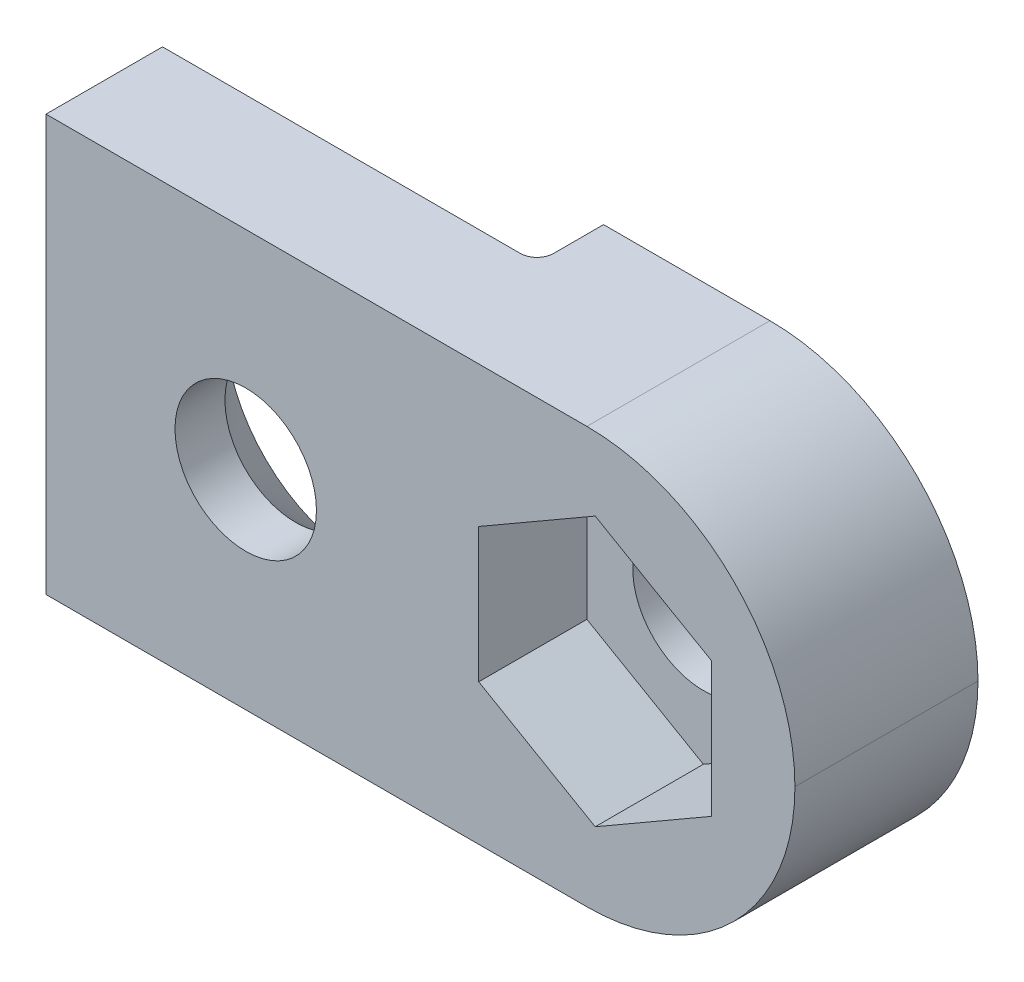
ISO-10303-21;
HEADER;
FILE_DESCRIPTION(('STEP AP214'),'2;1');
FILE_NAME('part.step','',(''),(''),'','','');
FILE_SCHEMA(('AUTOMOTIVE_DESIGN { 1 0 10303 214 1 1 1 1 }'));
ENDSEC;
DATA;
#1=APPLICATION_CONTEXT('core data for automotive mechanical design processes');
#2=APPLICATION_PROTOCOL_DEFINITION('international standard','automotive_design',2000,#1);
#3=PRODUCT_CONTEXT('',#1,'mechanical');
#4=PRODUCT('Part','Part','',(#3));
#5=PRODUCT_RELATED_PRODUCT_CATEGORY('part','',(#4));
#6=PRODUCT_DEFINITION_FORMATION('','',#4);
#7=PRODUCT_DEFINITION_CONTEXT('part definition',#1,'design');
#8=PRODUCT_DEFINITION('design','',#6,#7);
#9=PRODUCT_DEFINITION_SHAPE('','',#8);
#10=(LENGTH_UNIT() NAMED_UNIT(*) SI_UNIT(.MILLI.,.METRE.));
#11=(NAMED_UNIT(*) PLANE_ANGLE_UNIT() SI_UNIT($,.RADIAN.));
#12=(NAMED_UNIT(*) SI_UNIT($,.STERADIAN.) SOLID_ANGLE_UNIT());
#13=UNCERTAINTY_MEASURE_WITH_UNIT(LENGTH_MEASURE(1.E-05),#10,'distance_accuracy_value','');
#14=(GEOMETRIC_REPRESENTATION_CONTEXT(3) GLOBAL_UNCERTAINTY_ASSIGNED_CONTEXT((#13)) GLOBAL_UNIT_ASSIGNED_CONTEXT((#10,
#11,#12)) REPRESENTATION_CONTEXT('',''));
#15=CARTESIAN_POINT('',(0.,0.,0.));
#16=DIRECTION('',(0.,0.,1.));
#17=DIRECTION('',(1.,0.,0.));
#18=AXIS2_PLACEMENT_3D('',#15,#16,#17);
#19=CARTESIAN_POINT('',(-8.69268169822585,-1.07482881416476,4.4));
#20=DIRECTION('',(0.,0.,-1.));
#21=DIRECTION('',(-1.,0.,0.));
#22=AXIS2_PLACEMENT_3D('',#19,#20,#21);
#23=CYLINDRICAL_SURFACE('',#22,1.7);
#24=CARTESIAN_POINT('',(-8.69268169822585,-1.07482881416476,4.4));
#25=DIRECTION('',(0.,0.,1.));
#26=DIRECTION('',(1.,0.,0.));
#27=AXIS2_PLACEMENT_3D('',#24,#25,#26);
#28=CIRCLE('',#27,1.7);
#29=CARTESIAN_POINT('',(-6.99268169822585,-1.07482881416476,4.4));
#30=VERTEX_POINT('',#29);
#31=EDGE_CURVE('E252',#30,#30,#28,.T.);
#32=ORIENTED_EDGE('',*,*,#31,.T.);
#33=EDGE_LOOP('',(#32));
#34=FACE_BOUND('',#33,.T.);
#35=CARTESIAN_POINT('',(-8.69268169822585,-1.07482881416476,3.2));
#36=DIRECTION('',(0.,0.,-1.));
#37=DIRECTION('',(-1.,0.,0.));
#38=AXIS2_PLACEMENT_3D('',#35,#36,#37);
#39=CIRCLE('',#38,1.7);
#40=CARTESIAN_POINT('',(-10.3926816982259,-1.07482881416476,3.2));
#41=VERTEX_POINT('',#40);
#42=EDGE_CURVE('E277',#41,#41,#39,.T.);
#43=ORIENTED_EDGE('',*,*,#42,.T.);
#44=EDGE_LOOP('',(#43));
#45=FACE_BOUND('',#44,.T.);
#46=ADVANCED_FACE('F35',(#34,#45),#23,.F.);
#47=CARTESIAN_POINT('',(0.,0.,0.));
#48=DIRECTION('',(0.,0.,1.));
#49=DIRECTION('',(1.,0.,0.));
#50=AXIS2_PLACEMENT_3D('',#47,#48,#49);
#51=PLANE('',#50);
#52=CARTESIAN_POINT('',(-0.292681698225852,-1.07482881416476,0.));
#53=DIRECTION('',(0.,0.,1.));
#54=DIRECTION('',(1.,0.,0.));
#55=AXIS2_PLACEMENT_3D('',#52,#53,#54);
#56=CIRCLE('',#55,1.7);
#57=CARTESIAN_POINT('',(1.40731830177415,-1.07482881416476,0.));
#58=VERTEX_POINT('',#57);
#59=EDGE_CURVE('E196',#58,#58,#56,.T.);
#60=ORIENTED_EDGE('',*,*,#59,.T.);
#61=EDGE_LOOP('',(#60));
#62=FACE_BOUND('',#61,.T.);
#63=DIRECTION('',(0.,1.,0.));
#64=VECTOR('',#63,1.);
#65=CARTESIAN_POINT('',(-4.49268169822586,3.92517118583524,0.));
#66=LINE('',#65,#64);
#67=CARTESIAN_POINT('',(-4.49268169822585,-6.07482881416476,0.));
#68=VERTEX_POINT('',#67);
#69=CARTESIAN_POINT('',(-4.49268169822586,3.92517118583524,0.));
#70=VERTEX_POINT('',#69);
#71=EDGE_CURVE('E149',#68,#70,#66,.T.);
#72=ORIENTED_EDGE('',*,*,#71,.T.);
#73=DIRECTION('',(-1.,0.,0.));
#74=VECTOR('',#73,1.);
#75=CARTESIAN_POINT('',(-13.4926816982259,3.92517118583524,0.));
#76=LINE('',#75,#74);
#77=CARTESIAN_POINT('',(-0.492681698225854,3.92517118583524,0.));
#78=VERTEX_POINT('',#77);
#79=EDGE_CURVE('E194',#78,#70,#76,.T.);
#80=ORIENTED_EDGE('',*,*,#79,.F.);
#81=CARTESIAN_POINT('',(-0.492681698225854,-1.07482881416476,0.));
#82=DIRECTION('',(0.,0.,1.));
#83=DIRECTION('',(1.,0.,0.));
#84=AXIS2_PLACEMENT_3D('',#81,#82,#83);
#85=CIRCLE('',#84,5.);
#86=CARTESIAN_POINT('',(4.50731830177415,-1.07482881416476,0.));
#87=VERTEX_POINT('',#86);
#88=EDGE_CURVE('E156',#78,#87,#85,.F.);
#89=ORIENTED_EDGE('',*,*,#88,.T.);
#90=CARTESIAN_POINT('',(-0.492681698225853,-1.07482881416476,0.));
#91=DIRECTION('',(0.,0.,1.));
#92=DIRECTION('',(1.,0.,0.));
#93=AXIS2_PLACEMENT_3D('',#90,#91,#92);
#94=CIRCLE('',#93,5.);
#95=CARTESIAN_POINT('',(-0.492681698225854,-6.07482881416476,0.));
#96=VERTEX_POINT('',#95);
#97=EDGE_CURVE('E158',#87,#96,#94,.F.);
#98=ORIENTED_EDGE('',*,*,#97,.T.);
#99=DIRECTION('',(1.,0.,0.));
#100=VECTOR('',#99,1.);
#101=CARTESIAN_POINT('',(-13.4926816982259,-6.07482881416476,0.));
#102=LINE('',#101,#100);
#103=EDGE_CURVE('E255',#68,#96,#102,.T.);
#104=ORIENTED_EDGE('',*,*,#103,.F.);
#105=EDGE_LOOP('',(#72,#80,#89,#98,#104));
#106=FACE_BOUND('',#105,.T.);
#107=ADVANCED_FACE('F264',(#62,#106),#51,.F.);
#108=CARTESIAN_POINT('',(-13.4926816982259,-6.07482881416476,4.4));
#109=DIRECTION('',(0.,1.,0.));
#110=DIRECTION('',(0.,0.,1.));
#111=AXIS2_PLACEMENT_3D('',#108,#109,#110);
#112=PLANE('',#111);
#113=DIRECTION('',(1.,0.,0.));
#114=VECTOR('',#113,1.);
#115=CARTESIAN_POINT('',(-13.4926816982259,-6.07482881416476,1.6));
#116=LINE('',#115,#114);
#117=CARTESIAN_POINT('',(-13.4926816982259,-6.07482881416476,1.6));
#118=VERTEX_POINT('',#117);
#119=CARTESIAN_POINT('',(-4.89268169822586,-6.07482881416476,1.6));
#120=VERTEX_POINT('',#119);
#121=EDGE_CURVE('E132',#118,#120,#116,.T.);
#122=ORIENTED_EDGE('',*,*,#121,.T.);
#123=CARTESIAN_POINT('',(-4.89268169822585,-6.07482881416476,1.2));
#124=DIRECTION('',(0.,1.,0.));
#125=DIRECTION('',(0.,0.,1.));
#126=AXIS2_PLACEMENT_3D('',#123,#124,#125);
#127=CIRCLE('',#126,0.4);
#128=CARTESIAN_POINT('',(-4.49268169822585,-6.07482881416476,1.2));
#129=VERTEX_POINT('',#128);
#130=EDGE_CURVE('E11',#120,#129,#127,.T.);
#131=ORIENTED_EDGE('',*,*,#130,.T.);
#132=DIRECTION('',(0.,0.,-1.));
#133=VECTOR('',#132,1.);
#134=CARTESIAN_POINT('',(-4.49268169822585,-6.07482881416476,1.6));
#135=LINE('',#134,#133);
#136=EDGE_CURVE('E189',#129,#68,#135,.T.);
#137=ORIENTED_EDGE('',*,*,#136,.T.);
#138=ORIENTED_EDGE('',*,*,#103,.T.);
#139=DIRECTION('',(0.,0.,-1.));
#140=VECTOR('',#139,1.);
#141=CARTESIAN_POINT('',(-0.492681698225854,-6.07482881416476,4.4));
#142=LINE('',#141,#140);
#143=CARTESIAN_POINT('',(-0.492681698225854,-6.07482881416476,4.4));
#144=VERTEX_POINT('',#143);
#145=EDGE_CURVE('E166',#96,#144,#142,.F.);
#146=ORIENTED_EDGE('',*,*,#145,.T.);
#147=DIRECTION('',(1.,0.,0.));
#148=VECTOR('',#147,1.);
#149=CARTESIAN_POINT('',(-13.4926816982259,-6.07482881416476,4.4));
#150=LINE('',#149,#148);
#151=CARTESIAN_POINT('',(-13.4926816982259,-6.07482881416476,4.4));
#152=VERTEX_POINT('',#151);
#153=EDGE_CURVE('E154',#152,#144,#150,.T.);
#154=ORIENTED_EDGE('',*,*,#153,.F.);
#155=DIRECTION('',(0.,0.,-1.));
#156=VECTOR('',#155,1.);
#157=CARTESIAN_POINT('',(-13.4926816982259,-6.07482881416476,4.4));
#158=LINE('',#157,#156);
#159=EDGE_CURVE('E146',#152,#118,#158,.T.);
#160=ORIENTED_EDGE('',*,*,#159,.T.);
#161=EDGE_LOOP('',(#122,#131,#137,#138,#146,#154,#160));
#162=FACE_BOUND('',#161,.T.);
#163=ADVANCED_FACE('F151',(#162),#112,.F.);
#164=CARTESIAN_POINT('',(-13.4926816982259,3.92517118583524,4.4));
#165=DIRECTION('',(0.,-1.,0.));
#166=DIRECTION('',(0.,0.,-1.));
#167=AXIS2_PLACEMENT_3D('',#164,#165,#166);
#168=PLANE('',#167);
#169=DIRECTION('',(0.,0.,-1.));
#170=VECTOR('',#169,1.);
#171=CARTESIAN_POINT('',(-4.49268169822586,3.92517118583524,1.6));
#172=LINE('',#171,#170);
#173=CARTESIAN_POINT('',(-4.49268169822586,3.92517118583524,1.2));
#174=VERTEX_POINT('',#173);
#175=EDGE_CURVE('E187',#174,#70,#172,.T.);
#176=ORIENTED_EDGE('',*,*,#175,.F.);
#177=CARTESIAN_POINT('',(-4.89268169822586,3.92517118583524,1.2));
#178=DIRECTION('',(0.,-1.,0.));
#179=DIRECTION('',(0.,0.,-1.));
#180=AXIS2_PLACEMENT_3D('',#177,#178,#179);
#181=CIRCLE('',#180,0.4);
#182=CARTESIAN_POINT('',(-4.89268169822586,3.92517118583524,1.6));
#183=VERTEX_POINT('',#182);
#184=EDGE_CURVE('E43',#174,#183,#181,.T.);
#185=ORIENTED_EDGE('',*,*,#184,.T.);
#186=DIRECTION('',(-1.,0.,0.));
#187=VECTOR('',#186,1.);
#188=CARTESIAN_POINT('',(-13.4926816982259,3.92517118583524,1.6));
#189=LINE('',#188,#187);
#190=CARTESIAN_POINT('',(-13.4926816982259,3.92517118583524,1.6));
#191=VERTEX_POINT('',#190);
#192=EDGE_CURVE('E140',#183,#191,#189,.T.);
#193=ORIENTED_EDGE('',*,*,#192,.T.);
#194=DIRECTION('',(0.,0.,-1.));
#195=VECTOR('',#194,1.);
#196=CARTESIAN_POINT('',(-13.4926816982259,3.92517118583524,4.4));
#197=LINE('',#196,#195);
#198=CARTESIAN_POINT('',(-13.4926816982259,3.92517118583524,4.4));
#199=VERTEX_POINT('',#198);
#200=EDGE_CURVE('E148',#199,#191,#197,.T.);
#201=ORIENTED_EDGE('',*,*,#200,.F.);
#202=DIRECTION('',(-1.,0.,0.));
#203=VECTOR('',#202,1.);
#204=CARTESIAN_POINT('',(-13.4926816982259,3.92517118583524,4.4));
#205=LINE('',#204,#203);
#206=CARTESIAN_POINT('',(-0.492681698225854,3.92517118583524,4.4));
#207=VERTEX_POINT('',#206);
#208=EDGE_CURVE('E160',#207,#199,#205,.T.);
#209=ORIENTED_EDGE('',*,*,#208,.F.);
#210=DIRECTION('',(0.,0.,-1.));
#211=VECTOR('',#210,1.);
#212=CARTESIAN_POINT('',(-0.492681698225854,3.92517118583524,4.4));
#213=LINE('',#212,#211);
#214=EDGE_CURVE('E172',#207,#78,#213,.T.);
#215=ORIENTED_EDGE('',*,*,#214,.T.);
#216=ORIENTED_EDGE('',*,*,#79,.T.);
#217=EDGE_LOOP('',(#176,#185,#193,#201,#209,#215,#216));
#218=FACE_BOUND('',#217,.T.);
#219=ADVANCED_FACE('F192',(#218),#168,.F.);
#220=CARTESIAN_POINT('',(0.,0.,4.4));
#221=DIRECTION('',(0.,0.,1.));
#222=DIRECTION('',(1.,0.,0.));
#223=AXIS2_PLACEMENT_3D('',#220,#221,#222);
#224=PLANE('',#223);
#225=ORIENTED_EDGE('',*,*,#153,.T.);
#226=CARTESIAN_POINT('',(-0.492681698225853,-1.07482881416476,4.4));
#227=DIRECTION('',(0.,0.,1.));
#228=DIRECTION('',(1.,0.,0.));
#229=AXIS2_PLACEMENT_3D('',#226,#227,#228);
#230=CIRCLE('',#229,5.);
#231=CARTESIAN_POINT('',(4.50731830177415,-1.07482881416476,4.4));
#232=VERTEX_POINT('',#231);
#233=EDGE_CURVE('E170',#144,#232,#230,.T.);
#234=ORIENTED_EDGE('',*,*,#233,.T.);
#235=CARTESIAN_POINT('',(-0.492681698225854,-1.07482881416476,4.4));
#236=DIRECTION('',(0.,0.,1.));
#237=DIRECTION('',(1.,0.,0.));
#238=AXIS2_PLACEMENT_3D('',#235,#236,#237);
#239=CIRCLE('',#238,5.);
#240=EDGE_CURVE('E168',#232,#207,#239,.T.);
#241=ORIENTED_EDGE('',*,*,#240,.T.);
#242=ORIENTED_EDGE('',*,*,#208,.T.);
#243=DIRECTION('',(0.,-1.,0.));
#244=VECTOR('',#243,1.);
#245=CARTESIAN_POINT('',(-13.4926816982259,3.92517118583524,4.4));
#246=LINE('',#245,#244);
#247=EDGE_CURVE('E256',#199,#152,#246,.T.);
#248=ORIENTED_EDGE('',*,*,#247,.T.);
#249=EDGE_LOOP('',(#225,#234,#241,#242,#248));
#250=FACE_BOUND('',#249,.T.);
#251=ORIENTED_EDGE('',*,*,#31,.F.);
#252=EDGE_LOOP('',(#251));
#253=FACE_BOUND('',#252,.T.);
#254=DIRECTION('',(0.,1.,0.));
#255=VECTOR('',#254,1.);
#256=CARTESIAN_POINT('',(2.50731830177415,-2.69140956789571,4.4));
#257=LINE('',#256,#255);
#258=CARTESIAN_POINT('',(2.50731830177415,-2.69140956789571,4.4));
#259=VERTEX_POINT('',#258);
#260=CARTESIAN_POINT('',(2.50731830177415,0.54175193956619,4.4));
#261=VERTEX_POINT('',#260);
#262=EDGE_CURVE('E224',#259,#261,#257,.T.);
#263=ORIENTED_EDGE('',*,*,#262,.F.);
#264=DIRECTION('',(0.866025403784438,0.5,0.));
#265=VECTOR('',#264,1.);
#266=CARTESIAN_POINT('',(-0.292681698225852,-4.30799032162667,4.4));
#267=LINE('',#266,#265);
#268=CARTESIAN_POINT('',(-0.292681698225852,-4.30799032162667,4.4));
#269=VERTEX_POINT('',#268);
#270=EDGE_CURVE('E178',#269,#259,#267,.T.);
#271=ORIENTED_EDGE('',*,*,#270,.F.);
#272=DIRECTION('',(0.866025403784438,-0.5,0.));
#273=VECTOR('',#272,1.);
#274=CARTESIAN_POINT('',(-3.09268169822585,-2.69140956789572,4.4));
#275=LINE('',#274,#273);
#276=CARTESIAN_POINT('',(-3.09268169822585,-2.69140956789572,4.4));
#277=VERTEX_POINT('',#276);
#278=EDGE_CURVE('E233',#277,#269,#275,.T.);
#279=ORIENTED_EDGE('',*,*,#278,.F.);
#280=DIRECTION('',(0.,-1.,0.));
#281=VECTOR('',#280,1.);
#282=CARTESIAN_POINT('',(-3.09268169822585,0.541751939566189,4.4));
#283=LINE('',#282,#281);
#284=CARTESIAN_POINT('',(-3.09268169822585,0.541751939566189,4.4));
#285=VERTEX_POINT('',#284);
#286=EDGE_CURVE('E230',#285,#277,#283,.T.);
#287=ORIENTED_EDGE('',*,*,#286,.F.);
#288=DIRECTION('',(-0.866025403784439,-0.5,0.));
#289=VECTOR('',#288,1.);
#290=CARTESIAN_POINT('',(-0.292681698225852,2.15833269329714,4.4));
#291=LINE('',#290,#289);
#292=CARTESIAN_POINT('',(-0.292681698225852,2.15833269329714,4.4));
#293=VERTEX_POINT('',#292);
#294=EDGE_CURVE('E228',#293,#285,#291,.T.);
#295=ORIENTED_EDGE('',*,*,#294,.F.);
#296=DIRECTION('',(-0.866025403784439,0.5,0.));
#297=VECTOR('',#296,1.);
#298=CARTESIAN_POINT('',(2.50731830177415,0.54175193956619,4.4));
#299=LINE('',#298,#297);
#300=EDGE_CURVE('E226',#261,#293,#299,.T.);
#301=ORIENTED_EDGE('',*,*,#300,.F.);
#302=EDGE_LOOP('',(#263,#271,#279,#287,#295,#301));
#303=FACE_BOUND('',#302,.T.);
#304=ADVANCED_FACE('F271',(#250,#253,#303),#224,.T.);
#305=CARTESIAN_POINT('',(-13.4926816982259,3.92517118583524,4.4));
#306=DIRECTION('',(1.,0.,0.));
#307=DIRECTION('',(0.,1.,0.));
#308=AXIS2_PLACEMENT_3D('',#305,#306,#307);
#309=PLANE('',#308);
#310=ORIENTED_EDGE('',*,*,#200,.T.);
#311=DIRECTION('',(0.,-1.,0.));
#312=VECTOR('',#311,1.);
#313=CARTESIAN_POINT('',(-13.4926816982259,3.92517118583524,1.6));
#314=LINE('',#313,#312);
#315=EDGE_CURVE('E135',#191,#118,#314,.T.);
#316=ORIENTED_EDGE('',*,*,#315,.T.);
#317=ORIENTED_EDGE('',*,*,#159,.F.);
#318=ORIENTED_EDGE('',*,*,#247,.F.);
#319=EDGE_LOOP('',(#310,#316,#317,#318));
#320=FACE_BOUND('',#319,.T.);
#321=ADVANCED_FACE('F144',(#320),#309,.F.);
#322=CARTESIAN_POINT('',(-0.292681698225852,-4.30799032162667,4.4));
#323=DIRECTION('',(-0.5,0.866025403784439,0.));
#324=DIRECTION('',(-0.866025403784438,-0.5,0.));
#325=AXIS2_PLACEMENT_3D('',#322,#323,#324);
#326=PLANE('',#325);
#327=DIRECTION('',(0.866025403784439,0.5,0.));
#328=VECTOR('',#327,1.);
#329=CARTESIAN_POINT('',(-0.292681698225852,-4.30799032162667,1.8));
#330=LINE('',#329,#328);
#331=CARTESIAN_POINT('',(-0.292681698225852,-4.30799032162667,1.8));
#332=VERTEX_POINT('',#331);
#333=CARTESIAN_POINT('',(2.50731830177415,-2.69140956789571,1.8));
#334=VERTEX_POINT('',#333);
#335=EDGE_CURVE('E218',#332,#334,#330,.T.);
#336=ORIENTED_EDGE('',*,*,#335,.F.);
#337=DIRECTION('',(0.,0.,-1.));
#338=VECTOR('',#337,1.);
#339=CARTESIAN_POINT('',(-0.292681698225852,-4.30799032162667,4.4));
#340=LINE('',#339,#338);
#341=EDGE_CURVE('E235',#269,#332,#340,.T.);
#342=ORIENTED_EDGE('',*,*,#341,.F.);
#343=ORIENTED_EDGE('',*,*,#270,.T.);
#344=DIRECTION('',(0.,0.,-1.));
#345=VECTOR('',#344,1.);
#346=CARTESIAN_POINT('',(2.50731830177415,-2.69140956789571,4.4));
#347=LINE('',#346,#345);
#348=EDGE_CURVE('E249',#259,#334,#347,.T.);
#349=ORIENTED_EDGE('',*,*,#348,.T.);
#350=EDGE_LOOP('',(#336,#342,#343,#349));
#351=FACE_BOUND('',#350,.T.);
#352=ADVANCED_FACE('F309',(#351),#326,.T.);
#353=CARTESIAN_POINT('',(2.50731830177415,-2.69140956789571,4.4));
#354=DIRECTION('',(-1.,0.,0.));
#355=DIRECTION('',(0.,0.,1.));
#356=AXIS2_PLACEMENT_3D('',#353,#354,#355);
#357=PLANE('',#356);
#358=DIRECTION('',(0.,1.,0.));
#359=VECTOR('',#358,1.);
#360=CARTESIAN_POINT('',(2.50731830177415,-2.69140956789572,1.8));
#361=LINE('',#360,#359);
#362=CARTESIAN_POINT('',(2.50731830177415,0.54175193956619,1.8));
#363=VERTEX_POINT('',#362);
#364=EDGE_CURVE('E179',#334,#363,#361,.T.);
#365=ORIENTED_EDGE('',*,*,#364,.F.);
#366=ORIENTED_EDGE('',*,*,#348,.F.);
#367=ORIENTED_EDGE('',*,*,#262,.T.);
#368=DIRECTION('',(0.,0.,-1.));
#369=VECTOR('',#368,1.);
#370=CARTESIAN_POINT('',(2.50731830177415,0.54175193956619,4.4));
#371=LINE('',#370,#369);
#372=EDGE_CURVE('E246',#261,#363,#371,.T.);
#373=ORIENTED_EDGE('',*,*,#372,.T.);
#374=EDGE_LOOP('',(#365,#366,#367,#373));
#375=FACE_BOUND('',#374,.T.);
#376=ADVANCED_FACE('F343',(#375),#357,.T.);
#377=CARTESIAN_POINT('',(2.50731830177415,0.54175193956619,4.4));
#378=DIRECTION('',(-0.5,-0.866025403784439,0.));
#379=DIRECTION('',(0.866025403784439,-0.5,0.));
#380=AXIS2_PLACEMENT_3D('',#377,#378,#379);
#381=PLANE('',#380);
#382=DIRECTION('',(-0.866025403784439,0.5,0.));
#383=VECTOR('',#382,1.);
#384=CARTESIAN_POINT('',(2.50731830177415,0.54175193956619,1.8));
#385=LINE('',#384,#383);
#386=CARTESIAN_POINT('',(-0.292681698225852,2.15833269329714,1.8));
#387=VERTEX_POINT('',#386);
#388=EDGE_CURVE('E204',#363,#387,#385,.T.);
#389=ORIENTED_EDGE('',*,*,#388,.F.);
#390=ORIENTED_EDGE('',*,*,#372,.F.);
#391=ORIENTED_EDGE('',*,*,#300,.T.);
#392=DIRECTION('',(0.,0.,-1.));
#393=VECTOR('',#392,1.);
#394=CARTESIAN_POINT('',(-0.292681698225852,2.15833269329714,4.4));
#395=LINE('',#394,#393);
#396=EDGE_CURVE('E243',#293,#387,#395,.T.);
#397=ORIENTED_EDGE('',*,*,#396,.T.);
#398=EDGE_LOOP('',(#389,#390,#391,#397));
#399=FACE_BOUND('',#398,.T.);
#400=ADVANCED_FACE('F340',(#399),#381,.T.);
#401=CARTESIAN_POINT('',(-0.292681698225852,2.15833269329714,4.4));
#402=DIRECTION('',(0.5,-0.866025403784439,0.));
#403=DIRECTION('',(0.866025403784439,0.5,0.));
#404=AXIS2_PLACEMENT_3D('',#401,#402,#403);
#405=PLANE('',#404);
#406=DIRECTION('',(-0.866025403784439,-0.5,0.));
#407=VECTOR('',#406,1.);
#408=CARTESIAN_POINT('',(-0.292681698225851,2.15833269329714,1.8));
#409=LINE('',#408,#407);
#410=CARTESIAN_POINT('',(-3.09268169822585,0.541751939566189,1.8));
#411=VERTEX_POINT('',#410);
#412=EDGE_CURVE('E209',#387,#411,#409,.T.);
#413=ORIENTED_EDGE('',*,*,#412,.F.);
#414=ORIENTED_EDGE('',*,*,#396,.F.);
#415=ORIENTED_EDGE('',*,*,#294,.T.);
#416=DIRECTION('',(0.,0.,-1.));
#417=VECTOR('',#416,1.);
#418=CARTESIAN_POINT('',(-3.09268169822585,0.541751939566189,4.4));
#419=LINE('',#418,#417);
#420=EDGE_CURVE('E240',#285,#411,#419,.T.);
#421=ORIENTED_EDGE('',*,*,#420,.T.);
#422=EDGE_LOOP('',(#413,#414,#415,#421));
#423=FACE_BOUND('',#422,.T.);
#424=ADVANCED_FACE('F332',(#423),#405,.T.);
#425=CARTESIAN_POINT('',(-3.09268169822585,0.541751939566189,4.4));
#426=DIRECTION('',(1.,0.,0.));
#427=DIRECTION('',(0.,1.,0.));
#428=AXIS2_PLACEMENT_3D('',#425,#426,#427);
#429=PLANE('',#428);
#430=DIRECTION('',(0.,-1.,0.));
#431=VECTOR('',#430,1.);
#432=CARTESIAN_POINT('',(-3.09268169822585,0.54175193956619,1.8));
#433=LINE('',#432,#431);
#434=CARTESIAN_POINT('',(-3.09268169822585,-2.69140956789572,1.8));
#435=VERTEX_POINT('',#434);
#436=EDGE_CURVE('E212',#411,#435,#433,.T.);
#437=ORIENTED_EDGE('',*,*,#436,.F.);
#438=ORIENTED_EDGE('',*,*,#420,.F.);
#439=ORIENTED_EDGE('',*,*,#286,.T.);
#440=DIRECTION('',(0.,0.,-1.));
#441=VECTOR('',#440,1.);
#442=CARTESIAN_POINT('',(-3.09268169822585,-2.69140956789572,4.4));
#443=LINE('',#442,#441);
#444=EDGE_CURVE('E237',#277,#435,#443,.T.);
#445=ORIENTED_EDGE('',*,*,#444,.T.);
#446=EDGE_LOOP('',(#437,#438,#439,#445));
#447=FACE_BOUND('',#446,.T.);
#448=ADVANCED_FACE('F326',(#447),#429,.T.);
#449=CARTESIAN_POINT('',(-3.09268169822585,-2.69140956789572,4.4));
#450=DIRECTION('',(0.5,0.866025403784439,0.));
#451=DIRECTION('',(-0.866025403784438,0.5,0.));
#452=AXIS2_PLACEMENT_3D('',#449,#450,#451);
#453=PLANE('',#452);
#454=DIRECTION('',(0.866025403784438,-0.5,0.));
#455=VECTOR('',#454,1.);
#456=CARTESIAN_POINT('',(-3.09268169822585,-2.69140956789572,1.8));
#457=LINE('',#456,#455);
#458=EDGE_CURVE('E215',#435,#332,#457,.T.);
#459=ORIENTED_EDGE('',*,*,#458,.F.);
#460=ORIENTED_EDGE('',*,*,#444,.F.);
#461=ORIENTED_EDGE('',*,*,#278,.T.);
#462=ORIENTED_EDGE('',*,*,#341,.T.);
#463=EDGE_LOOP('',(#459,#460,#461,#462));
#464=FACE_BOUND('',#463,.T.);
#465=ADVANCED_FACE('F322',(#464),#453,.T.);
#466=CARTESIAN_POINT('',(-0.492681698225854,-1.07482881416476,4.4));
#467=DIRECTION('',(0.,0.,-1.));
#468=DIRECTION('',(-1.,0.,0.));
#469=AXIS2_PLACEMENT_3D('',#466,#467,#468);
#470=CYLINDRICAL_SURFACE('',#469,5.);
#471=ORIENTED_EDGE('',*,*,#214,.F.);
#472=ORIENTED_EDGE('',*,*,#240,.F.);
#473=DIRECTION('',(0.,0.,-1.));
#474=VECTOR('',#473,1.);
#475=CARTESIAN_POINT('',(4.50731830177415,-1.07482881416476,4.4));
#476=LINE('',#475,#474);
#477=EDGE_CURVE('E175',#87,#232,#476,.F.);
#478=ORIENTED_EDGE('',*,*,#477,.F.);
#479=ORIENTED_EDGE('',*,*,#88,.F.);
#480=EDGE_LOOP('',(#471,#472,#478,#479));
#481=FACE_BOUND('',#480,.T.);
#482=ADVANCED_FACE('F276',(#481),#470,.T.);
#483=CARTESIAN_POINT('',(-0.492681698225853,-1.07482881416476,4.4));
#484=DIRECTION('',(0.,0.,-1.));
#485=DIRECTION('',(-1.,0.,0.));
#486=AXIS2_PLACEMENT_3D('',#483,#484,#485);
#487=CYLINDRICAL_SURFACE('',#486,5.);
#488=ORIENTED_EDGE('',*,*,#233,.F.);
#489=ORIENTED_EDGE('',*,*,#145,.F.);
#490=ORIENTED_EDGE('',*,*,#97,.F.);
#491=ORIENTED_EDGE('',*,*,#477,.T.);
#492=EDGE_LOOP('',(#488,#489,#490,#491));
#493=FACE_BOUND('',#492,.T.);
#494=ADVANCED_FACE('F268',(#493),#487,.T.);
#495=CARTESIAN_POINT('',(0.,0.,1.8));
#496=DIRECTION('',(0.,0.,1.));
#497=DIRECTION('',(1.,0.,0.));
#498=AXIS2_PLACEMENT_3D('',#495,#496,#497);
#499=PLANE('',#498);
#500=ORIENTED_EDGE('',*,*,#388,.T.);
#501=ORIENTED_EDGE('',*,*,#412,.T.);
#502=ORIENTED_EDGE('',*,*,#436,.T.);
#503=ORIENTED_EDGE('',*,*,#458,.T.);
#504=ORIENTED_EDGE('',*,*,#335,.T.);
#505=ORIENTED_EDGE('',*,*,#364,.T.);
#506=EDGE_LOOP('',(#500,#501,#502,#503,#504,#505));
#507=FACE_BOUND('',#506,.T.);
#508=CARTESIAN_POINT('',(-0.292681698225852,-1.07482881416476,1.8));
#509=DIRECTION('',(0.,0.,1.));
#510=DIRECTION('',(1.,0.,0.));
#511=AXIS2_PLACEMENT_3D('',#508,#509,#510);
#512=CIRCLE('',#511,1.7);
#513=CARTESIAN_POINT('',(1.40731830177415,-1.07482881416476,1.8));
#514=VERTEX_POINT('',#513);
#515=EDGE_CURVE('E201',#514,#514,#512,.T.);
#516=ORIENTED_EDGE('',*,*,#515,.F.);
#517=EDGE_LOOP('',(#516));
#518=FACE_BOUND('',#517,.T.);
#519=ADVANCED_FACE('F320',(#507,#518),#499,.T.);
#520=CARTESIAN_POINT('',(-0.292681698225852,-1.07482881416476,1.8));
#521=DIRECTION('',(0.,0.,-1.));
#522=DIRECTION('',(-1.,0.,0.));
#523=AXIS2_PLACEMENT_3D('',#520,#521,#522);
#524=CYLINDRICAL_SURFACE('',#523,1.7);
#525=ORIENTED_EDGE('',*,*,#515,.T.);
#526=EDGE_LOOP('',(#525));
#527=FACE_BOUND('',#526,.T.);
#528=ORIENTED_EDGE('',*,*,#59,.F.);
#529=EDGE_LOOP('',(#528));
#530=FACE_BOUND('',#529,.T.);
#531=ADVANCED_FACE('F297',(#527,#530),#524,.F.);
#532=CARTESIAN_POINT('',(-4.49268169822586,3.92517118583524,1.6));
#533=DIRECTION('',(-1.,0.,0.));
#534=DIRECTION('',(0.,-1.,0.));
#535=AXIS2_PLACEMENT_3D('',#532,#533,#534);
#536=PLANE('',#535);
#537=ORIENTED_EDGE('',*,*,#136,.F.);
#538=DIRECTION('',(0.,1.,0.));
#539=VECTOR('',#538,1.);
#540=CARTESIAN_POINT('',(-4.49268169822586,3.92517118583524,1.2));
#541=LINE('',#540,#539);
#542=EDGE_CURVE('E174',#129,#174,#541,.T.);
#543=ORIENTED_EDGE('',*,*,#542,.T.);
#544=ORIENTED_EDGE('',*,*,#175,.T.);
#545=ORIENTED_EDGE('',*,*,#71,.F.);
#546=EDGE_LOOP('',(#537,#543,#544,#545));
#547=FACE_BOUND('',#546,.T.);
#548=ADVANCED_FACE('F185',(#547),#536,.T.);
#549=CARTESIAN_POINT('',(0.,0.,1.6));
#550=DIRECTION('',(0.,0.,1.));
#551=DIRECTION('',(1.,0.,0.));
#552=AXIS2_PLACEMENT_3D('',#549,#550,#551);
#553=PLANE('',#552);
#554=CARTESIAN_POINT('',(-8.69268169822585,-1.07482881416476,1.6));
#555=DIRECTION('',(0.,0.,-1.));
#556=DIRECTION('',(-1.,0.,0.));
#557=AXIS2_PLACEMENT_3D('',#554,#555,#556);
#558=CIRCLE('',#557,3.3);
#559=CARTESIAN_POINT('',(-11.9926816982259,-1.07482881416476,1.6));
#560=VERTEX_POINT('',#559);
#561=EDGE_CURVE('E279',#560,#560,#558,.T.);
#562=ORIENTED_EDGE('',*,*,#561,.F.);
#563=EDGE_LOOP('',(#562));
#564=FACE_BOUND('',#563,.T.);
#565=ORIENTED_EDGE('',*,*,#192,.F.);
#566=DIRECTION('',(0.,1.,0.));
#567=VECTOR('',#566,1.);
#568=CARTESIAN_POINT('',(-4.89268169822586,0.,1.6));
#569=LINE('',#568,#567);
#570=EDGE_CURVE('E50',#183,#120,#569,.F.);
#571=ORIENTED_EDGE('',*,*,#570,.T.);
#572=ORIENTED_EDGE('',*,*,#121,.F.);
#573=ORIENTED_EDGE('',*,*,#315,.F.);
#574=EDGE_LOOP('',(#565,#571,#572,#573));
#575=FACE_BOUND('',#574,.T.);
#576=ADVANCED_FACE('F134',(#564,#575),#553,.F.);
#577=CARTESIAN_POINT('',(-8.69268169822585,-1.07482881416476,1.6));
#578=DIRECTION('',(0.,0.,-1.));
#579=DIRECTION('',(-1.,0.,0.));
#580=AXIS2_PLACEMENT_3D('',#577,#578,#579);
#581=CONICAL_SURFACE('',#580,3.3,0.785398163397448);
#582=ORIENTED_EDGE('',*,*,#42,.F.);
#583=EDGE_LOOP('',(#582));
#584=FACE_BOUND('',#583,.T.);
#585=ORIENTED_EDGE('',*,*,#561,.T.);
#586=EDGE_LOOP('',(#585));
#587=FACE_BOUND('',#586,.T.);
#588=ADVANCED_FACE('F287',(#584,#587),#581,.F.);
#589=CARTESIAN_POINT('',(-4.89268169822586,3.92517118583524,1.2));
#590=DIRECTION('',(0.,1.,0.));
#591=DIRECTION('',(-1.,0.,0.));
#592=AXIS2_PLACEMENT_3D('',#589,#590,#591);
#593=CYLINDRICAL_SURFACE('',#592,0.4);
#594=ORIENTED_EDGE('',*,*,#130,.F.);
#595=ORIENTED_EDGE('',*,*,#570,.F.);
#596=ORIENTED_EDGE('',*,*,#184,.F.);
#597=ORIENTED_EDGE('',*,*,#542,.F.);
#598=EDGE_LOOP('',(#594,#595,#596,#597));
#599=FACE_BOUND('',#598,.T.);
#600=ADVANCED_FACE('F37',(#599),#593,.F.);
#601=CLOSED_SHELL('',(#46,#107,#163,#219,#304,#321,#352,#376,#400,#424,#448,#465,#482,#494,#519,
#531,#548,#576,#588,#600));
#602=MANIFOLD_SOLID_BREP('B2',#601);
#603=ADVANCED_BREP_SHAPE_REPRESENTATION('',(#18,#602),#14);
#604=SHAPE_DEFINITION_REPRESENTATION(#9,#603);
ENDSEC;
END-ISO-10303-21;
